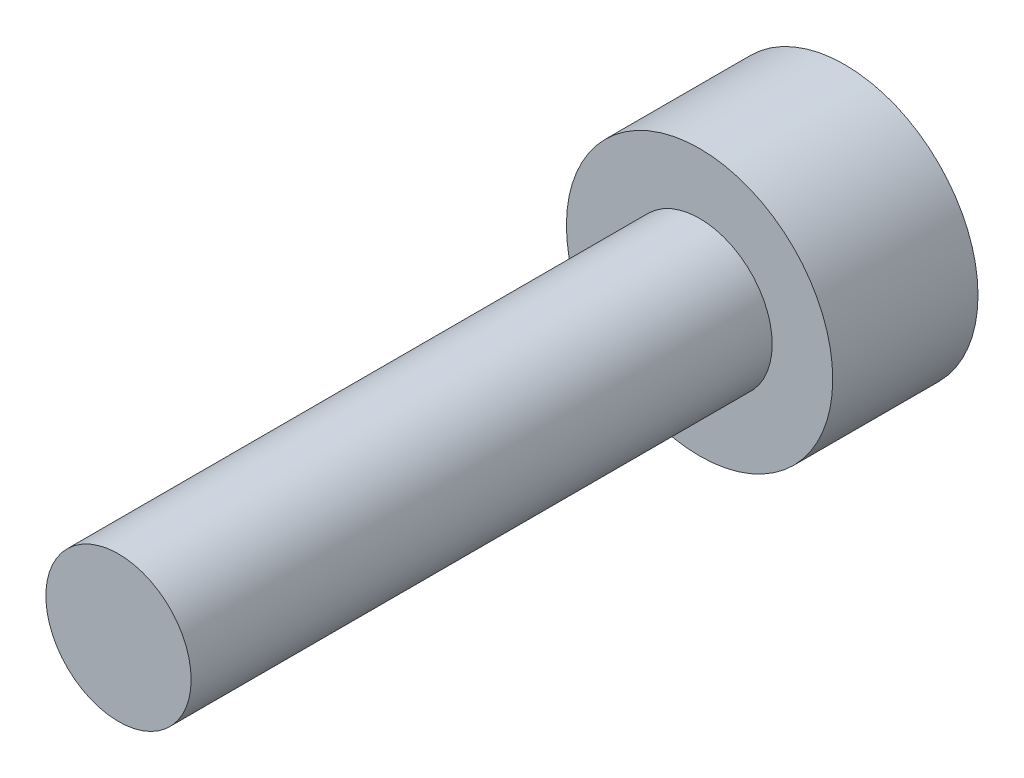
ISO-10303-21;
HEADER;
FILE_DESCRIPTION(('STEP AP214'),'2;1');
FILE_NAME('part.step','',(''),(''),'','','');
FILE_SCHEMA(('AUTOMOTIVE_DESIGN { 1 0 10303 214 1 1 1 1 }'));
ENDSEC;
DATA;
#1=APPLICATION_CONTEXT('core data for automotive mechanical design processes');
#2=APPLICATION_PROTOCOL_DEFINITION('international standard','automotive_design',2000,#1);
#3=PRODUCT_CONTEXT('',#1,'mechanical');
#4=PRODUCT('Part','Part','',(#3));
#5=PRODUCT_RELATED_PRODUCT_CATEGORY('part','',(#4));
#6=PRODUCT_DEFINITION_FORMATION('','',#4);
#7=PRODUCT_DEFINITION_CONTEXT('part definition',#1,'design');
#8=PRODUCT_DEFINITION('design','',#6,#7);
#9=PRODUCT_DEFINITION_SHAPE('','',#8);
#10=(LENGTH_UNIT() NAMED_UNIT(*) SI_UNIT(.MILLI.,.METRE.));
#11=(NAMED_UNIT(*) PLANE_ANGLE_UNIT() SI_UNIT($,.RADIAN.));
#12=(NAMED_UNIT(*) SI_UNIT($,.STERADIAN.) SOLID_ANGLE_UNIT());
#13=UNCERTAINTY_MEASURE_WITH_UNIT(LENGTH_MEASURE(1.E-05),#10,'distance_accuracy_value','');
#14=(GEOMETRIC_REPRESENTATION_CONTEXT(3) GLOBAL_UNCERTAINTY_ASSIGNED_CONTEXT((#13)) GLOBAL_UNIT_ASSIGNED_CONTEXT((#10,
#11,#12)) REPRESENTATION_CONTEXT('',''));
#15=CARTESIAN_POINT('',(0.,0.,0.));
#16=DIRECTION('',(0.,0.,1.));
#17=DIRECTION('',(1.,0.,0.));
#18=AXIS2_PLACEMENT_3D('',#15,#16,#17);
#19=CARTESIAN_POINT('',(0.,0.,12.));
#20=DIRECTION('',(0.,0.,1.));
#21=DIRECTION('',(1.,0.,0.));
#22=AXIS2_PLACEMENT_3D('',#19,#20,#21);
#23=PLANE('',#22);
#24=CARTESIAN_POINT('',(0.,0.,12.));
#25=DIRECTION('',(0.,0.,1.));
#26=DIRECTION('',(1.,0.,0.));
#27=AXIS2_PLACEMENT_3D('',#24,#25,#26);
#28=CIRCLE('',#27,1.5);
#29=CARTESIAN_POINT('',(1.5,0.,12.));
#30=VERTEX_POINT('',#29);
#31=EDGE_CURVE('E11',#30,#30,#28,.T.);
#32=ORIENTED_EDGE('',*,*,#31,.T.);
#33=EDGE_LOOP('',(#32));
#34=FACE_BOUND('',#33,.T.);
#35=ADVANCED_FACE('F33',(#34),#23,.T.);
#36=CARTESIAN_POINT('',(0.,0.,12.));
#37=DIRECTION('',(0.,0.,1.));
#38=DIRECTION('',(1.,0.,0.));
#39=AXIS2_PLACEMENT_3D('',#36,#37,#38);
#40=CYLINDRICAL_SURFACE('',#39,1.5);
#41=CARTESIAN_POINT('',(0.,0.,0.));
#42=DIRECTION('',(0.,0.,1.));
#43=DIRECTION('',(1.,0.,0.));
#44=AXIS2_PLACEMENT_3D('',#41,#42,#43);
#45=CIRCLE('',#44,1.5);
#46=CARTESIAN_POINT('',(1.5,0.,0.));
#47=VERTEX_POINT('',#46);
#48=EDGE_CURVE('E40',#47,#47,#45,.T.);
#49=ORIENTED_EDGE('',*,*,#48,.T.);
#50=EDGE_LOOP('',(#49));
#51=FACE_BOUND('',#50,.T.);
#52=ORIENTED_EDGE('',*,*,#31,.F.);
#53=EDGE_LOOP('',(#52));
#54=FACE_BOUND('',#53,.T.);
#55=ADVANCED_FACE('F147',(#51,#54),#40,.T.);
#56=CARTESIAN_POINT('',(0.,-1.5,0.));
#57=DIRECTION('',(0.,0.,1.));
#58=DIRECTION('',(1.,0.,0.));
#59=AXIS2_PLACEMENT_3D('',#56,#57,#58);
#60=PLANE('',#59);
#61=CARTESIAN_POINT('',(0.,0.,0.));
#62=DIRECTION('',(0.,0.,1.));
#63=DIRECTION('',(1.,0.,0.));
#64=AXIS2_PLACEMENT_3D('',#61,#62,#63);
#65=CIRCLE('',#64,2.75);
#66=CARTESIAN_POINT('',(2.75,0.,0.));
#67=VERTEX_POINT('',#66);
#68=EDGE_CURVE('E142',#67,#67,#65,.T.);
#69=ORIENTED_EDGE('',*,*,#68,.T.);
#70=EDGE_LOOP('',(#69));
#71=FACE_BOUND('',#70,.T.);
#72=ORIENTED_EDGE('',*,*,#48,.F.);
#73=EDGE_LOOP('',(#72));
#74=FACE_BOUND('',#73,.T.);
#75=ADVANCED_FACE('F150',(#71,#74),#60,.T.);
#76=CARTESIAN_POINT('',(0.,0.,12.));
#77=DIRECTION('',(0.,0.,1.));
#78=DIRECTION('',(1.,0.,0.));
#79=AXIS2_PLACEMENT_3D('',#76,#77,#78);
#80=CYLINDRICAL_SURFACE('',#79,2.75);
#81=CARTESIAN_POINT('',(0.,0.,-3.));
#82=DIRECTION('',(0.,0.,1.));
#83=DIRECTION('',(1.,0.,0.));
#84=AXIS2_PLACEMENT_3D('',#81,#82,#83);
#85=CIRCLE('',#84,2.75);
#86=CARTESIAN_POINT('',(2.75,0.,-3.));
#87=VERTEX_POINT('',#86);
#88=EDGE_CURVE('E134',#87,#87,#85,.T.);
#89=ORIENTED_EDGE('',*,*,#88,.T.);
#90=EDGE_LOOP('',(#89));
#91=FACE_BOUND('',#90,.T.);
#92=ORIENTED_EDGE('',*,*,#68,.F.);
#93=EDGE_LOOP('',(#92));
#94=FACE_BOUND('',#93,.T.);
#95=ADVANCED_FACE('F152',(#91,#94),#80,.T.);
#96=CARTESIAN_POINT('',(0.,-2.75,-3.));
#97=DIRECTION('',(0.,0.,-1.));
#98=DIRECTION('',(-1.,0.,0.));
#99=AXIS2_PLACEMENT_3D('',#96,#97,#98);
#100=PLANE('',#99);
#101=DIRECTION('',(0.866025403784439,-0.5,0.));
#102=VECTOR('',#101,1.);
#103=CARTESIAN_POINT('',(0.,1.44337567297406,-3.));
#104=LINE('',#103,#102);
#105=CARTESIAN_POINT('',(0.,1.44337567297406,-3.));
#106=VERTEX_POINT('',#105);
#107=CARTESIAN_POINT('',(1.25,0.721687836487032,-3.));
#108=VERTEX_POINT('',#107);
#109=EDGE_CURVE('E47',#106,#108,#104,.T.);
#110=ORIENTED_EDGE('',*,*,#109,.F.);
#111=DIRECTION('',(0.866025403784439,0.5,0.));
#112=VECTOR('',#111,1.);
#113=CARTESIAN_POINT('',(-1.25,0.721687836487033,-3.));
#114=LINE('',#113,#112);
#115=CARTESIAN_POINT('',(-1.25,0.721687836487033,-3.));
#116=VERTEX_POINT('',#115);
#117=EDGE_CURVE('E130',#116,#106,#114,.T.);
#118=ORIENTED_EDGE('',*,*,#117,.F.);
#119=DIRECTION('',(0.,1.,0.));
#120=VECTOR('',#119,1.);
#121=CARTESIAN_POINT('',(-1.25,-0.721687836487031,-3.));
#122=LINE('',#121,#120);
#123=CARTESIAN_POINT('',(-1.25,-0.721687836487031,-3.));
#124=VERTEX_POINT('',#123);
#125=EDGE_CURVE('E128',#124,#116,#122,.T.);
#126=ORIENTED_EDGE('',*,*,#125,.F.);
#127=DIRECTION('',(-0.866025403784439,0.5,0.));
#128=VECTOR('',#127,1.);
#129=CARTESIAN_POINT('',(0.,-1.44337567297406,-3.));
#130=LINE('',#129,#128);
#131=CARTESIAN_POINT('',(0.,-1.44337567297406,-3.));
#132=VERTEX_POINT('',#131);
#133=EDGE_CURVE('E95',#132,#124,#130,.T.);
#134=ORIENTED_EDGE('',*,*,#133,.F.);
#135=DIRECTION('',(-0.866025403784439,-0.5,0.));
#136=VECTOR('',#135,1.);
#137=CARTESIAN_POINT('',(1.25,-0.721687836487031,-3.));
#138=LINE('',#137,#136);
#139=CARTESIAN_POINT('',(1.25,-0.721687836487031,-3.));
#140=VERTEX_POINT('',#139);
#141=EDGE_CURVE('E124',#140,#132,#138,.T.);
#142=ORIENTED_EDGE('',*,*,#141,.F.);
#143=DIRECTION('',(0.,-1.,0.));
#144=VECTOR('',#143,1.);
#145=CARTESIAN_POINT('',(1.25,0.721687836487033,-3.));
#146=LINE('',#145,#144);
#147=EDGE_CURVE('E121',#108,#140,#146,.T.);
#148=ORIENTED_EDGE('',*,*,#147,.F.);
#149=EDGE_LOOP('',(#110,#118,#126,#134,#142,#148));
#150=FACE_BOUND('',#149,.T.);
#151=ORIENTED_EDGE('',*,*,#88,.F.);
#152=EDGE_LOOP('',(#151));
#153=FACE_BOUND('',#152,.T.);
#154=ADVANCED_FACE('F159',(#150,#153),#100,.T.);
#155=CARTESIAN_POINT('',(0.,1.44337567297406,-0.5));
#156=DIRECTION('',(0.5,0.866025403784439,0.));
#157=DIRECTION('',(-0.866025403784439,0.5,0.));
#158=AXIS2_PLACEMENT_3D('',#155,#156,#157);
#159=PLANE('',#158);
#160=ORIENTED_EDGE('',*,*,#109,.T.);
#161=DIRECTION('',(0.,0.,-1.));
#162=VECTOR('',#161,1.);
#163=CARTESIAN_POINT('',(1.25,0.721687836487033,-0.5));
#164=LINE('',#163,#162);
#165=CARTESIAN_POINT('',(1.25,0.721687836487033,-0.5));
#166=VERTEX_POINT('',#165);
#167=EDGE_CURVE('E77',#166,#108,#164,.T.);
#168=ORIENTED_EDGE('',*,*,#167,.F.);
#169=DIRECTION('',(0.866025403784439,-0.5,0.));
#170=VECTOR('',#169,1.);
#171=CARTESIAN_POINT('',(0.,1.44337567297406,-0.5));
#172=LINE('',#171,#170);
#173=CARTESIAN_POINT('',(0.,1.44337567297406,-0.5));
#174=VERTEX_POINT('',#173);
#175=EDGE_CURVE('E132',#174,#166,#172,.T.);
#176=ORIENTED_EDGE('',*,*,#175,.F.);
#177=DIRECTION('',(0.,0.,-1.));
#178=VECTOR('',#177,1.);
#179=CARTESIAN_POINT('',(0.,1.44337567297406,-0.5));
#180=LINE('',#179,#178);
#181=EDGE_CURVE('E55',#174,#106,#180,.T.);
#182=ORIENTED_EDGE('',*,*,#181,.T.);
#183=EDGE_LOOP('',(#160,#168,#176,#182));
#184=FACE_BOUND('',#183,.T.);
#185=ADVANCED_FACE('F190',(#184),#159,.F.);
#186=CARTESIAN_POINT('',(-1.25,0.721687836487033,-0.5));
#187=DIRECTION('',(-0.5,0.866025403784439,0.));
#188=DIRECTION('',(-0.866025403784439,-0.5,0.));
#189=AXIS2_PLACEMENT_3D('',#186,#187,#188);
#190=PLANE('',#189);
#191=ORIENTED_EDGE('',*,*,#117,.T.);
#192=ORIENTED_EDGE('',*,*,#181,.F.);
#193=DIRECTION('',(0.866025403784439,0.5,0.));
#194=VECTOR('',#193,1.);
#195=CARTESIAN_POINT('',(-1.25,0.721687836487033,-0.5));
#196=LINE('',#195,#194);
#197=CARTESIAN_POINT('',(-1.25,0.721687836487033,-0.5));
#198=VERTEX_POINT('',#197);
#199=EDGE_CURVE('E107',#198,#174,#196,.T.);
#200=ORIENTED_EDGE('',*,*,#199,.F.);
#201=DIRECTION('',(0.,0.,-1.));
#202=VECTOR('',#201,1.);
#203=CARTESIAN_POINT('',(-1.25,0.721687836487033,-0.5));
#204=LINE('',#203,#202);
#205=EDGE_CURVE('E99',#198,#116,#204,.T.);
#206=ORIENTED_EDGE('',*,*,#205,.T.);
#207=EDGE_LOOP('',(#191,#192,#200,#206));
#208=FACE_BOUND('',#207,.T.);
#209=ADVANCED_FACE('F200',(#208),#190,.F.);
#210=CARTESIAN_POINT('',(-1.25,-0.721687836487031,-0.5));
#211=DIRECTION('',(-1.,0.,0.));
#212=DIRECTION('',(0.,0.,1.));
#213=AXIS2_PLACEMENT_3D('',#210,#211,#212);
#214=PLANE('',#213);
#215=ORIENTED_EDGE('',*,*,#125,.T.);
#216=ORIENTED_EDGE('',*,*,#205,.F.);
#217=DIRECTION('',(0.,1.,0.));
#218=VECTOR('',#217,1.);
#219=CARTESIAN_POINT('',(-1.25,-0.721687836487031,-0.5));
#220=LINE('',#219,#218);
#221=CARTESIAN_POINT('',(-1.25,-0.721687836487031,-0.5));
#222=VERTEX_POINT('',#221);
#223=EDGE_CURVE('E103',#222,#198,#220,.T.);
#224=ORIENTED_EDGE('',*,*,#223,.F.);
#225=DIRECTION('',(0.,0.,-1.));
#226=VECTOR('',#225,1.);
#227=CARTESIAN_POINT('',(-1.25,-0.721687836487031,-0.5));
#228=LINE('',#227,#226);
#229=EDGE_CURVE('E88',#222,#124,#228,.T.);
#230=ORIENTED_EDGE('',*,*,#229,.T.);
#231=EDGE_LOOP('',(#215,#216,#224,#230));
#232=FACE_BOUND('',#231,.T.);
#233=ADVANCED_FACE('F104',(#232),#214,.F.);
#234=CARTESIAN_POINT('',(0.,-1.44337567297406,-0.5));
#235=DIRECTION('',(-0.5,-0.866025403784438,0.));
#236=DIRECTION('',(0.866025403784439,-0.5,0.));
#237=AXIS2_PLACEMENT_3D('',#234,#235,#236);
#238=PLANE('',#237);
#239=ORIENTED_EDGE('',*,*,#133,.T.);
#240=ORIENTED_EDGE('',*,*,#229,.F.);
#241=DIRECTION('',(-0.866025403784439,0.5,0.));
#242=VECTOR('',#241,1.);
#243=CARTESIAN_POINT('',(0.,-1.44337567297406,-0.5));
#244=LINE('',#243,#242);
#245=CARTESIAN_POINT('',(0.,-1.44337567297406,-0.5));
#246=VERTEX_POINT('',#245);
#247=EDGE_CURVE('E92',#246,#222,#244,.T.);
#248=ORIENTED_EDGE('',*,*,#247,.F.);
#249=DIRECTION('',(0.,0.,-1.));
#250=VECTOR('',#249,1.);
#251=CARTESIAN_POINT('',(0.,-1.44337567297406,-0.5));
#252=LINE('',#251,#250);
#253=EDGE_CURVE('E100',#246,#132,#252,.T.);
#254=ORIENTED_EDGE('',*,*,#253,.T.);
#255=EDGE_LOOP('',(#239,#240,#248,#254));
#256=FACE_BOUND('',#255,.T.);
#257=ADVANCED_FACE('F90',(#256),#238,.F.);
#258=CARTESIAN_POINT('',(1.25,-0.721687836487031,-0.5));
#259=DIRECTION('',(0.5,-0.866025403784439,0.));
#260=DIRECTION('',(0.866025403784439,0.5,0.));
#261=AXIS2_PLACEMENT_3D('',#258,#259,#260);
#262=PLANE('',#261);
#263=ORIENTED_EDGE('',*,*,#141,.T.);
#264=ORIENTED_EDGE('',*,*,#253,.F.);
#265=DIRECTION('',(-0.866025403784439,-0.5,0.));
#266=VECTOR('',#265,1.);
#267=CARTESIAN_POINT('',(1.25,-0.721687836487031,-0.5));
#268=LINE('',#267,#266);
#269=CARTESIAN_POINT('',(1.25,-0.721687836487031,-0.5));
#270=VERTEX_POINT('',#269);
#271=EDGE_CURVE('E113',#270,#246,#268,.T.);
#272=ORIENTED_EDGE('',*,*,#271,.F.);
#273=DIRECTION('',(0.,0.,-1.));
#274=VECTOR('',#273,1.);
#275=CARTESIAN_POINT('',(1.25,-0.721687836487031,-0.5));
#276=LINE('',#275,#274);
#277=EDGE_CURVE('E137',#270,#140,#276,.T.);
#278=ORIENTED_EDGE('',*,*,#277,.T.);
#279=EDGE_LOOP('',(#263,#264,#272,#278));
#280=FACE_BOUND('',#279,.T.);
#281=ADVANCED_FACE('F225',(#280),#262,.F.);
#282=CARTESIAN_POINT('',(1.25,0.721687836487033,-0.5));
#283=DIRECTION('',(1.,0.,0.));
#284=DIRECTION('',(0.,0.,-1.));
#285=AXIS2_PLACEMENT_3D('',#282,#283,#284);
#286=PLANE('',#285);
#287=ORIENTED_EDGE('',*,*,#147,.T.);
#288=ORIENTED_EDGE('',*,*,#277,.F.);
#289=DIRECTION('',(0.,-1.,0.));
#290=VECTOR('',#289,1.);
#291=CARTESIAN_POINT('',(1.25,0.721687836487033,-0.5));
#292=LINE('',#291,#290);
#293=EDGE_CURVE('E115',#166,#270,#292,.T.);
#294=ORIENTED_EDGE('',*,*,#293,.F.);
#295=ORIENTED_EDGE('',*,*,#167,.T.);
#296=EDGE_LOOP('',(#287,#288,#294,#295));
#297=FACE_BOUND('',#296,.T.);
#298=ADVANCED_FACE('F234',(#297),#286,.F.);
#299=CARTESIAN_POINT('',(2.5,0.,-0.5));
#300=DIRECTION('',(0.,0.,-1.));
#301=DIRECTION('',(-1.,0.,0.));
#302=AXIS2_PLACEMENT_3D('',#299,#300,#301);
#303=PLANE('',#302);
#304=ORIENTED_EDGE('',*,*,#175,.T.);
#305=ORIENTED_EDGE('',*,*,#293,.T.);
#306=ORIENTED_EDGE('',*,*,#271,.T.);
#307=ORIENTED_EDGE('',*,*,#247,.T.);
#308=ORIENTED_EDGE('',*,*,#223,.T.);
#309=ORIENTED_EDGE('',*,*,#199,.T.);
#310=EDGE_LOOP('',(#304,#305,#306,#307,#308,#309));
#311=FACE_BOUND('',#310,.T.);
#312=ADVANCED_FACE('F110',(#311),#303,.T.);
#313=CLOSED_SHELL('',(#35,#55,#75,#95,#154,#185,#209,#233,#257,#281,#298,#312));
#314=MANIFOLD_SOLID_BREP('B2',#313);
#315=ADVANCED_BREP_SHAPE_REPRESENTATION('',(#18,#314),#14);
#316=SHAPE_DEFINITION_REPRESENTATION(#9,#315);
ENDSEC;
END-ISO-10303-21;
